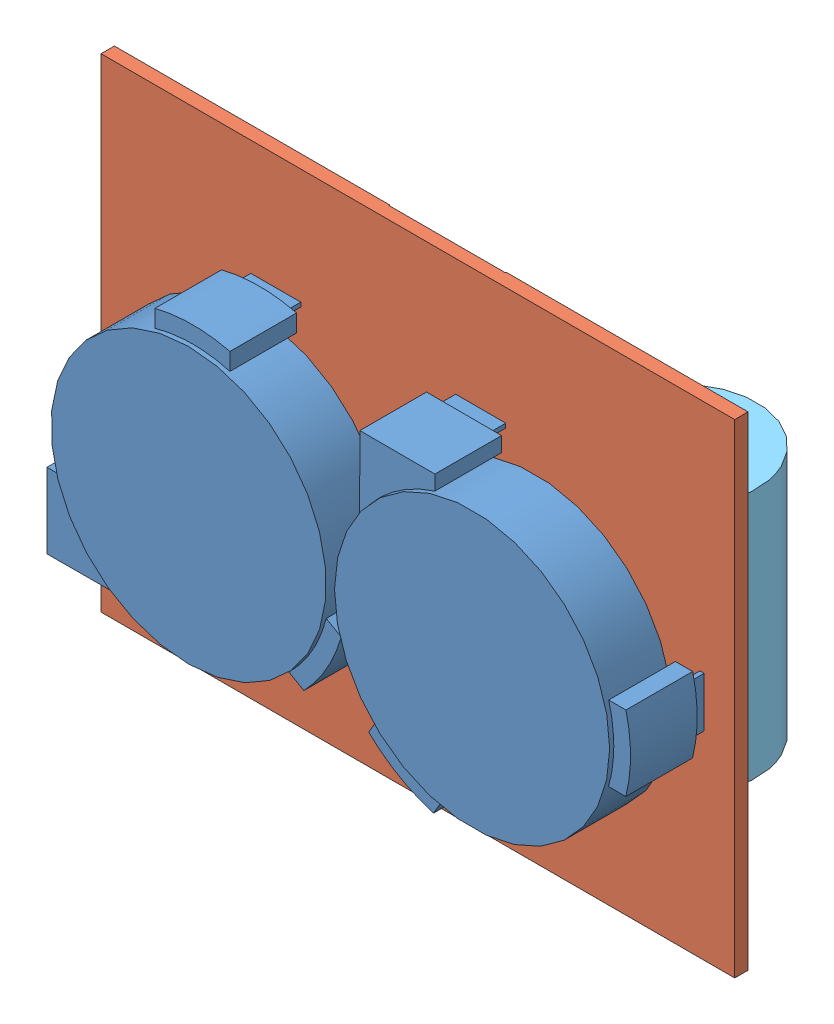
SolidWorks assembly 3836700 carte buzzer RB0505.SLDASM, configuration Défaut (file format 5000). Lengths in mm.
Overall size (76 58 32.44).
8 component instances, 7 part files, 11 mates.
Components (placement in the parent):
- buzzer1-1: buzzer1.SLDPRT [Défaut] at (2.41 -5.26 -1) x (-0.002539 0.999997 0) z (0 0 1) size (35 35.29 11.5)
- carte buzzer-1: carte buzzer.SLDPRT [Défaut] at (-0.0901 -3.1084 -5.6) size (76 58 1.6)
- buzzer1-3: buzzer1.SLDPRT [Défaut] at (36.41 -5.26 -1) x (0.999998 -0.002045 0) z (0 0 1) size (35 35.29 11.5)
- transfo-1: transfo.SLDPRT [Défaut] at (-4.41 7.3416 0) x (-1 0 0) z (0 1 0) size (25 15 28.22)
- cache transfo-1: cache transfo.SLDPRT [Défaut] at (-4.41 7.3416 0) x (-1 0 0) z (0 1 0) size (27 15 23)
- condensateur-1: condensateur.SLDPRT [Défaut] at (40.4114 9.3916 -14.6) x (0.951318 0 -0.308211) z (0 -1 0) size (18 18 30)
- 3838600 etiq ID+code barre revB-1: 3838600 etiq ID+code barre revB.SLDPRT [Default] at (8.061 21.5534 -5.6) x (-1 0 0) z (0 0 -1) size (25 12 0.2)
- switch-1: switch.SLDPRT [Défaut] at (-3.5901 -22.1084 -5.6) x (1 0 0) z (0 0 -1) size (10 2.5 6.5)
Mates (geometry in assembly coordinates):
- Distance1: distance = 3 mm anti-aligned: plane of buzzer1-3 through (36.41 -5.26 -1) normal (0 0 -1); plane of carte buzzer-1 through (-18.5901 25.8916 -4) normal (0 0 1)
- Distance2: distance = 3 mm anti-aligned: plane of buzzer1-1 through (2.41 -5.26 -1) normal (0 0 -1); plane of carte buzzer-1 through (-18.5901 25.8916 -4) normal (0 0 1)
- Parallèle1: parallel anti-aligned: plane of carte buzzer-1 through (-18.5901 25.8916 -4) normal (0 1 0); plane of condensateur-1 through (40.4114 -20.6084 -14.6) normal (0 -1 0)
- Distance3: distance = 16.5 mm aligned: plane of condensateur-1 through (40.4114 9.3916 -14.6) normal (0 1 0); plane of carte buzzer-1 through (-18.5901 25.8916 -4) normal (0 1 0)
- Tangent1: tangent anti-aligned: plane of carte buzzer-1 through (-18.5901 25.8916 -5.6) normal (0 0 -1); cylinder of condensateur-1 through (40.4114 -20.6084 -14.6) axis (0 1 0) radius 9
- Coïncidente4: coincident anti-aligned: plane of carte buzzer-1 through (-18.5901 25.8916 -5.6) normal (0 0 -1); plane of 3838600 etiq ID+code barre revB-1 through (8.9099 21.8916 -5.6) normal (0 0 1)
- Distance6: distance = 7.5 mm aligned: plane of switch-1 through (-3.5901 -24.6084 -12.1) normal (0 -1 0); plane of carte buzzer-1 through (-18.5901 -32.1084 -4) normal (0 -1 0)
- Distance7: distance = 15 mm aligned: plane of switch-1 through (-3.5901 -22.1084 -12.1) normal (-1 0 0); plane of carte buzzer-1 through (-18.5901 25.8916 -4) normal (-1 0 0)
- Coïncidente7: coincident anti-aligned: plane of carte buzzer-1 through (-18.5901 25.8916 -5.6) normal (0 0 -1); plane of switch-1 through (-3.5901 -24.6084 -5.6) normal (0 0 1)
- Distance9: distance = 25.5 mm aligned: plane of carte buzzer-1 through (-18.5901 25.8916 -4) normal (-1 0 0); plane of 3838600 etiq ID+code barre revB-1 through (6.9099 21.8916 -5.8) normal (-1 0 0)
- Distance10: distance = 2 mm aligned: plane of carte buzzer-1 through (-18.5901 25.8916 -4) normal (0 1 0); plane of 3838600 etiq ID+code barre revB-1 through (29.9099 23.8916 -5.8) normal (0 1 0)
